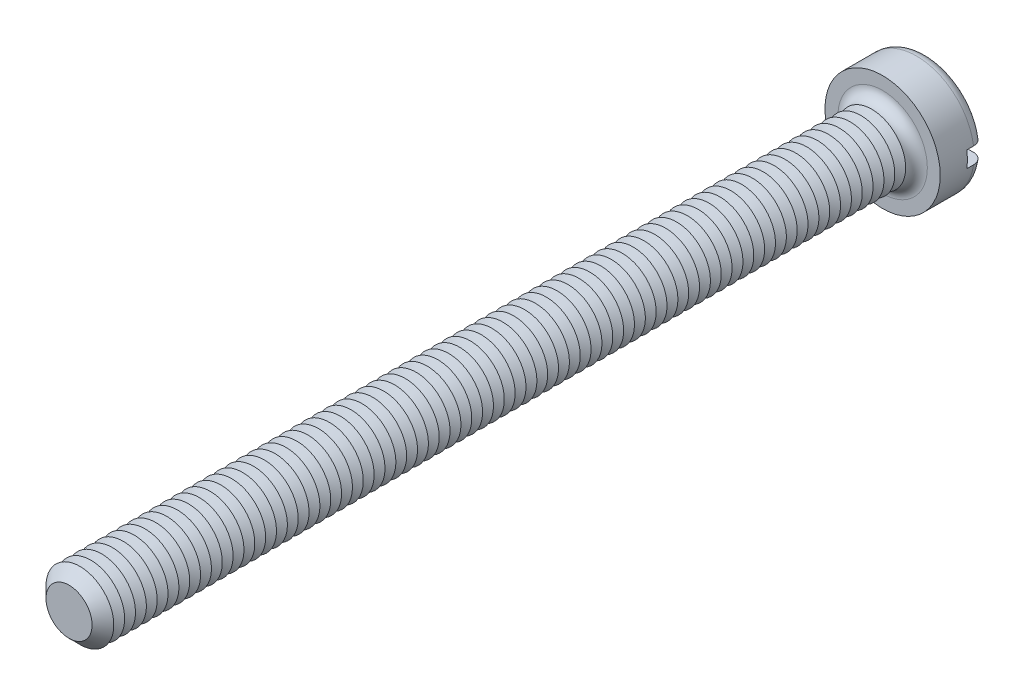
from build123d import *

# Parameters (mm, degrees)
SKETCH3_R           = 4.25
BOSS_EXTRUDE2_DEPTH = 3.3
SKETCH4_R           = 2.5
BOSS_EXTRUDE3_DEPTH = 60
FILLET1_R           = 0.8
CHAMFER1_SIZE       = 0.8
LPATTERN1_COUNT     = 73
LPATTERN1_PITCH     = 0.8
SKETCH8_W           = 8.5
SKETCH8_H           = 1.2
CUT_EXTRUDE1_DEPTH  = 1.3


with BuildPart() as part:
    # Sketch3 → Boss-Extrude2 (new body)
    with BuildSketch(Plane.XY):
        Circle(SKETCH3_R)
    extrude(amount=-BOSS_EXTRUDE2_DEPTH)

    # Sketch4 → Boss-Extrude3 (add)
    with BuildSketch(Plane.XY):
        Circle(SKETCH4_R)
    extrude(amount=BOSS_EXTRUDE3_DEPTH)

    # Fillet1
    fillet1_edges = [part.edges().sort_by_distance(p)[0] for p in [
        (-4.25, 0, -3.3),
        (-2.5, 0, 0),
    ]]
    fillet(fillet1_edges, radius=FILLET1_R)

    # Chamfer1
    chamfer1_edges = [part.edges().sort_by_distance(p)[0] for p in [
        (-2.5, 0, 60),
    ]]
    chamfer(chamfer1_edges, length=CHAMFER1_SIZE)

    # Sketch6 → Cut-Revolve1 (revolve, cut)
    with BuildSketch(Plane(origin=(0, 0, 0), x_dir=(0, 0, -1), z_dir=(1, 0, 0)), mode=Mode.PRIVATE) as cut_revolve1_sk:
        Polygon((-0.8, 2.5), (-1.2, 1.807179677), (-1.6, 2.5), align=None)
    cut_revolve1 = revolve(cut_revolve1_sk.sketch.rotate(Axis((0, 0, -1.694361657), (0, 0, 1)), 90), axis=Axis((0, 0, -1.694361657), (0, 0, 1)), mode=Mode.SUBTRACT)

    # LPattern1: Cut-Revolve1 ×73
    with Locations(*[(0, 0, i * LPATTERN1_PITCH) for i in range(1, LPATTERN1_COUNT)]):
        add(cut_revolve1, mode=Mode.SUBTRACT)

    # Sketch8 → Cut-Extrude1 (cut)
    with BuildSketch(Plane(origin=(0, 0, -3.3), x_dir=(-1, 0, 0), z_dir=(0, 0, -1))):
        Rectangle(SKETCH8_W, SKETCH8_H)
    extrude(amount=-CUT_EXTRUDE1_DEPTH, mode=Mode.SUBTRACT)


solid = part.part
